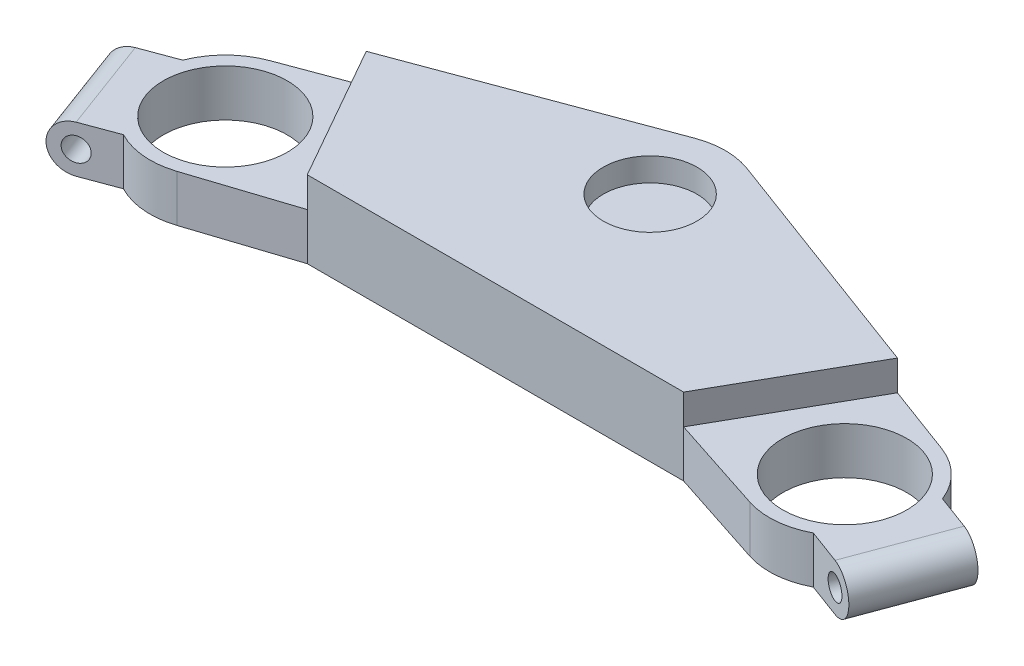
from build123d import *

# Parameters (mm, degrees)
BOSS_EXTRUDE1_DEPTH = 23
SKETCH2_R           = 18.51
CUT_EXTRUDE1_DEPTH  = 131.337270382
SKETCH3_R           = 13.985
CUT_EXTRUDE2_DEPTH  = 7
BOSS_EXTRUDE2_START = -23
BOSS_EXTRUDE2_DEPTH = 23
CUT_EXTRUDE3_DEPTH  = 148.097143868
SKETCH10_R          = 3.5
CUT_EXTRUDE5_DEPTH  = 42
CUT_EXTRUDE8_DEPTH  = 148.097143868
CUT_EXTRUDE9_DEPTH  = 9
SKETCH15_R          = 3.5
CUT_EXTRUDE10_DEPTH = 146.122708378


with BuildPart() as part:
    # Sketch1 → Boss-Extrude1 (new body)
    with BuildSketch(Plane(origin=(0, 0, 0), x_dir=(1, 0, 0), z_dir=(0, 1, 0))):
        with BuildLine():
            Line((-100.336081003, -13.275177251), (-7.836081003, 21.091368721))
            ThreePointArc((-7.836081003, 21.091368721), (0, 22.5), (7.836081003, 21.091368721))
            Line((7.836081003, 21.091368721), (100.336081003, -13.275177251))
            ThreePointArc((100.336081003, -13.275177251), (113.745786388, -41.773742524), (85.524728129, -55.758029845))
            Line((85.524728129, -55.758029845), (56.196116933, -46.194642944))
            Line((56.196116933, -46.194642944), (-56.196116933, -46.194642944))
            Line((-56.196116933, -46.194642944), (-85.524728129, -55.758029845))
            ThreePointArc((-85.524728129, -55.758029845), (-113.745786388, -41.773742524), (-100.336081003, -13.275177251))
        make_face()
    extrude(amount=BOSS_EXTRUDE1_DEPTH)

    # Sketch2 → Cut-Extrude1 (cut, through all)
    with BuildSketch(Plane(origin=(0, 23, 0), x_dir=(1, 0, 0), z_dir=(0, 1, 0))):
        with Locations(Location((-92.5, -34.366545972, 0), (0, 0, 270))):
            Circle(SKETCH2_R)
        with Locations(Location((92.5, -34.366545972, 0), (0, 0, 270))):
            Circle(SKETCH2_R)
    extrude(amount=-CUT_EXTRUDE1_DEPTH, mode=Mode.SUBTRACT)

    # Sketch3 → Cut-Extrude2 (cut)
    with BuildSketch(Plane(origin=(0, 23, 0), x_dir=(1, 0, 0), z_dir=(0, 1, 0))):
        with Locations(Location((0, 0, 0), (0, 0, 270))):
            Circle(SKETCH3_R)
    extrude(amount=-CUT_EXTRUDE2_DEPTH, mode=Mode.SUBTRACT)

    # Sketch4 → Boss-Extrude2 (add)
    with BuildSketch(Plane(origin=(0, 23, 0), x_dir=(1, 0, 0), z_dir=(0, 1, 0)).offset(BOSS_EXTRUDE2_START)):
        with BuildLine():
            Line((-113.444632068, -26.146303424), (-132.192515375, -33.11170876))
            Line((-132.192515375, -33.11170876), (-121.744407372, -61.233533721))
            Line((-121.744407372, -61.233533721), (-102.996524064, -54.268128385))
            ThreePointArc((-102.996524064, -54.268128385), (-113.591368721, -42.202626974), (-113.444632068, -26.146303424))
        make_face()
        with BuildLine():
            Line((113.444632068, -26.146303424), (132.192515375, -33.11170876))
            Line((132.192515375, -33.11170876), (121.744407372, -61.233533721))
            Line((121.744407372, -61.233533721), (102.996524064, -54.268128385))
            ThreePointArc((102.996524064, -54.268128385), (113.591368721, -42.202626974), (113.444632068, -26.146303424))
        make_face()
    extrude(amount=BOSS_EXTRUDE2_DEPTH)

    # Sketch5 → Cut-Extrude3 (cut, through all)
    with BuildSketch(Plane(origin=(5.224054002, 0, 14.060912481), x_dir=(0.9373941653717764, 0, -0.3482702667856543), z_dir=(0.3482702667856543, 0, 0.9373941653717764))):
        with BuildLine():
            Line((-135.448316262, 0), (-135.448316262, 14))
            Line((-135.448316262, 14), (-126.448316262, 14))
            ThreePointArc((-126.448316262, 14), (-133.448316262, 7), (-126.448316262, 0))
            Line((-126.448316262, 0), (-135.448316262, 0))
        make_face()
    extrude(amount=-CUT_EXTRUDE3_DEPTH, mode=Mode.SUBTRACT)

    # Sketch10 → Cut-Extrude5 (cut)
    with BuildSketch(Plane(origin=(5.224054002, 0, 14.060912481), x_dir=(0.9373941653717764, 0, -0.3482702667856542), z_dir=(0.3482702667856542, 0, 0.9373941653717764))):
        with Locations((-126.448316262, 7)):
            Circle(SKETCH10_R)
    extrude(amount=-CUT_EXTRUDE5_DEPTH, mode=Mode.SUBTRACT)

    # Sketch13 → Cut-Extrude8 (cut, through all)
    with BuildSketch(Plane(origin=(-5.224054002, 0, 14.060912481), x_dir=(0.9373941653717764, 0, 0.3482702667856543), z_dir=(-0.34827026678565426, 0, 0.9373941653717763))):
        with BuildLine():
            Line((126.448316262, 14), (135.448316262, 14))
            Line((135.448316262, 14), (135.448316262, 0))
            Line((135.448316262, 0), (126.448316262, 0))
            ThreePointArc((126.448316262, 0), (133.448316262, 7), (126.448316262, 14))
        make_face()
    extrude(amount=-CUT_EXTRUDE8_DEPTH, mode=Mode.SUBTRACT)

    # Sketch14 → Cut-Extrude9 (cut)
    with BuildSketch(Plane(origin=(0, 23, 0), x_dir=(1, 0, 0), z_dir=(0, 1, 0))):
        Polygon((-56.196116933, -46.194642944), (-93.033770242, 18.702535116), (-179.483612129, -24.236128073), (-123.538544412, -84.420295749), align=None)
        Polygon((179.483612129, -24.236128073), (123.538544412, -84.420295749), (56.196116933, -46.194642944), (93.033770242, 18.702535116), align=None)
    extrude(amount=-CUT_EXTRUDE9_DEPTH, mode=Mode.SUBTRACT)

    # Sketch15 → Cut-Extrude10 (cut, through all)
    with BuildSketch(Plane(origin=(-5.224054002, 0, 14.060912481), x_dir=(0.9373941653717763, 0, 0.3482702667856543), z_dir=(-0.3482702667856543, 0, 0.9373941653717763))):
        with Locations((126.448316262, 7)):
            Circle(SKETCH15_R)
    extrude(amount=-CUT_EXTRUDE10_DEPTH, mode=Mode.SUBTRACT)


solid = part.part
